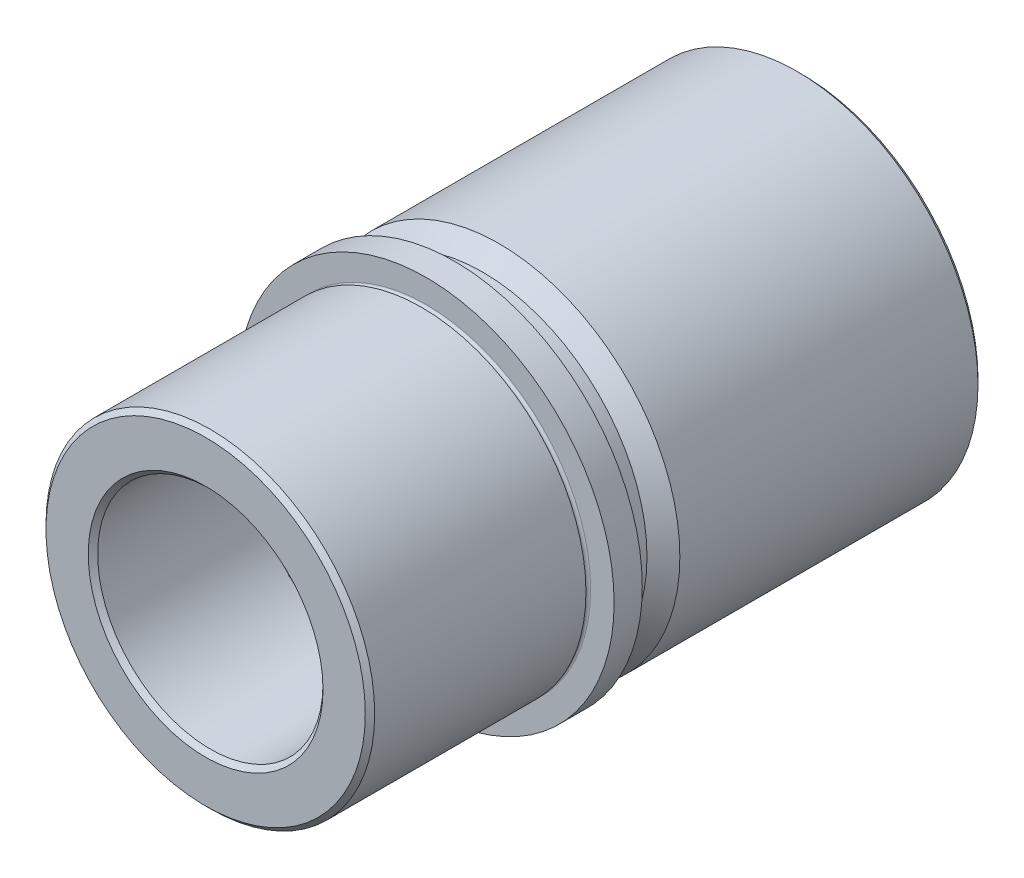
ISO-10303-21;
HEADER;
FILE_DESCRIPTION(('STEP AP214'),'2;1');
FILE_NAME('part.step','',(''),(''),'','','');
FILE_SCHEMA(('AUTOMOTIVE_DESIGN { 1 0 10303 214 1 1 1 1 }'));
ENDSEC;
DATA;
#1=APPLICATION_CONTEXT('core data for automotive mechanical design processes');
#2=APPLICATION_PROTOCOL_DEFINITION('international standard','automotive_design',2000,#1);
#3=PRODUCT_CONTEXT('',#1,'mechanical');
#4=PRODUCT('Part','Part','',(#3));
#5=PRODUCT_RELATED_PRODUCT_CATEGORY('part','',(#4));
#6=PRODUCT_DEFINITION_FORMATION('','',#4);
#7=PRODUCT_DEFINITION_CONTEXT('part definition',#1,'design');
#8=PRODUCT_DEFINITION('design','',#6,#7);
#9=PRODUCT_DEFINITION_SHAPE('','',#8);
#10=(LENGTH_UNIT() NAMED_UNIT(*) SI_UNIT(.MILLI.,.METRE.));
#11=(NAMED_UNIT(*) PLANE_ANGLE_UNIT() SI_UNIT($,.RADIAN.));
#12=(NAMED_UNIT(*) SI_UNIT($,.STERADIAN.) SOLID_ANGLE_UNIT());
#13=UNCERTAINTY_MEASURE_WITH_UNIT(LENGTH_MEASURE(1.E-05),#10,'distance_accuracy_value','');
#14=(GEOMETRIC_REPRESENTATION_CONTEXT(3) GLOBAL_UNCERTAINTY_ASSIGNED_CONTEXT((#13)) GLOBAL_UNIT_ASSIGNED_CONTEXT((#10,
#11,#12)) REPRESENTATION_CONTEXT('',''));
#15=CARTESIAN_POINT('',(0.,0.,0.));
#16=DIRECTION('',(0.,0.,1.));
#17=DIRECTION('',(1.,0.,0.));
#18=AXIS2_PLACEMENT_3D('',#15,#16,#17);
#19=CARTESIAN_POINT('',(0.,0.,-83.5));
#20=DIRECTION('',(0.,0.,1.));
#21=DIRECTION('',(1.,0.,0.));
#22=AXIS2_PLACEMENT_3D('',#19,#20,#21);
#23=TOROIDAL_SURFACE('',#22,24.5,0.5);
#24=CARTESIAN_POINT('',(0.,0.,-83.5));
#25=DIRECTION('',(0.,0.,1.));
#26=DIRECTION('',(1.,0.,0.));
#27=AXIS2_PLACEMENT_3D('',#24,#25,#26);
#28=CIRCLE('',#27,24.);
#29=CARTESIAN_POINT('',(24.,0.,-83.5));
#30=VERTEX_POINT('',#29);
#31=EDGE_CURVE('E81',#30,#30,#28,.T.);
#32=ORIENTED_EDGE('',*,*,#31,.T.);
#33=EDGE_LOOP('',(#32));
#34=FACE_BOUND('',#33,.T.);
#35=CARTESIAN_POINT('',(0.,0.,-84.));
#36=DIRECTION('',(0.,0.,1.));
#37=DIRECTION('',(1.,0.,0.));
#38=AXIS2_PLACEMENT_3D('',#35,#36,#37);
#39=CIRCLE('',#38,24.5);
#40=CARTESIAN_POINT('',(24.5,0.,-84.));
#41=VERTEX_POINT('',#40);
#42=EDGE_CURVE('E45',#41,#41,#39,.T.);
#43=ORIENTED_EDGE('',*,*,#42,.F.);
#44=EDGE_LOOP('',(#43));
#45=FACE_BOUND('',#44,.T.);
#46=ADVANCED_FACE('F13',(#34,#45),#23,.T.);
#47=CARTESIAN_POINT('',(0.,0.,-84.5));
#48=DIRECTION('',(0.,0.,1.));
#49=DIRECTION('',(1.,0.,0.));
#50=AXIS2_PLACEMENT_3D('',#47,#48,#49);
#51=TOROIDAL_SURFACE('',#50,24.5,0.5);
#52=CARTESIAN_POINT('',(0.,0.,-84.5));
#53=DIRECTION('',(0.,0.,1.));
#54=DIRECTION('',(1.,0.,0.));
#55=AXIS2_PLACEMENT_3D('',#52,#53,#54);
#56=CIRCLE('',#55,24.);
#57=CARTESIAN_POINT('',(24.,0.,-84.5));
#58=VERTEX_POINT('',#57);
#59=EDGE_CURVE('E48',#58,#58,#56,.T.);
#60=ORIENTED_EDGE('',*,*,#59,.F.);
#61=EDGE_LOOP('',(#60));
#62=FACE_BOUND('',#61,.T.);
#63=ORIENTED_EDGE('',*,*,#42,.T.);
#64=EDGE_LOOP('',(#63));
#65=FACE_BOUND('',#64,.T.);
#66=ADVANCED_FACE('F113',(#62,#65),#51,.T.);
#67=CARTESIAN_POINT('',(0.,0.,0.));
#68=DIRECTION('',(0.,0.,1.));
#69=DIRECTION('',(1.,0.,0.));
#70=AXIS2_PLACEMENT_3D('',#67,#68,#69);
#71=CYLINDRICAL_SURFACE('',#70,24.);
#72=CARTESIAN_POINT('',(0.,0.,-126.));
#73=DIRECTION('',(0.,0.,1.));
#74=DIRECTION('',(1.,0.,0.));
#75=AXIS2_PLACEMENT_3D('',#72,#73,#74);
#76=CIRCLE('',#75,24.);
#77=CARTESIAN_POINT('',(24.,0.,-126.));
#78=VERTEX_POINT('',#77);
#79=EDGE_CURVE('E36',#78,#78,#76,.F.);
#80=ORIENTED_EDGE('',*,*,#79,.T.);
#81=EDGE_LOOP('',(#80));
#82=FACE_BOUND('',#81,.T.);
#83=ORIENTED_EDGE('',*,*,#59,.T.);
#84=EDGE_LOOP('',(#83));
#85=FACE_BOUND('',#84,.T.);
#86=ADVANCED_FACE('F118',(#82,#85),#71,.F.);
#87=CARTESIAN_POINT('',(0.,0.,-127.));
#88=DIRECTION('',(0.,0.,1.));
#89=DIRECTION('',(1.,0.,0.));
#90=AXIS2_PLACEMENT_3D('',#87,#88,#89);
#91=PLANE('',#90);
#92=CARTESIAN_POINT('',(0.,0.,-127.));
#93=DIRECTION('',(0.,0.,1.));
#94=DIRECTION('',(1.,0.,0.));
#95=AXIS2_PLACEMENT_3D('',#92,#93,#94);
#96=CIRCLE('',#95,25.);
#97=CARTESIAN_POINT('',(25.,0.,-127.));
#98=VERTEX_POINT('',#97);
#99=EDGE_CURVE('E39',#98,#98,#96,.T.);
#100=ORIENTED_EDGE('',*,*,#99,.T.);
#101=EDGE_LOOP('',(#100));
#102=FACE_BOUND('',#101,.T.);
#103=CARTESIAN_POINT('',(0.,0.,-127.));
#104=DIRECTION('',(0.,0.,1.));
#105=DIRECTION('',(1.,0.,0.));
#106=AXIS2_PLACEMENT_3D('',#103,#104,#105);
#107=CIRCLE('',#106,37.5);
#108=CARTESIAN_POINT('',(37.5,0.,-127.));
#109=VERTEX_POINT('',#108);
#110=EDGE_CURVE('E42',#109,#109,#107,.F.);
#111=ORIENTED_EDGE('',*,*,#110,.T.);
#112=EDGE_LOOP('',(#111));
#113=FACE_BOUND('',#112,.T.);
#114=ADVANCED_FACE('F185',(#102,#113),#91,.F.);
#115=CARTESIAN_POINT('',(0.,0.,0.));
#116=DIRECTION('',(0.,0.,1.));
#117=DIRECTION('',(1.,0.,0.));
#118=AXIS2_PLACEMENT_3D('',#115,#116,#117);
#119=CYLINDRICAL_SURFACE('',#118,38.5);
#120=CARTESIAN_POINT('',(0.,0.,-126.));
#121=DIRECTION('',(0.,0.,1.));
#122=DIRECTION('',(1.,0.,0.));
#123=AXIS2_PLACEMENT_3D('',#120,#121,#122);
#124=CIRCLE('',#123,38.5);
#125=CARTESIAN_POINT('',(38.5,0.,-126.));
#126=VERTEX_POINT('',#125);
#127=EDGE_CURVE('E33',#126,#126,#124,.T.);
#128=ORIENTED_EDGE('',*,*,#127,.T.);
#129=EDGE_LOOP('',(#128));
#130=FACE_BOUND('',#129,.T.);
#131=CARTESIAN_POINT('',(0.,0.,-62.5));
#132=DIRECTION('',(0.,0.,1.));
#133=DIRECTION('',(1.,0.,0.));
#134=AXIS2_PLACEMENT_3D('',#131,#132,#133);
#135=CIRCLE('',#134,38.5);
#136=CARTESIAN_POINT('',(38.5,0.,-62.5));
#137=VERTEX_POINT('',#136);
#138=EDGE_CURVE('E51',#137,#137,#135,.T.);
#139=ORIENTED_EDGE('',*,*,#138,.F.);
#140=EDGE_LOOP('',(#139));
#141=FACE_BOUND('',#140,.T.);
#142=ADVANCED_FACE('F181',(#130,#141),#119,.T.);
#143=CARTESIAN_POINT('',(0.,0.,-59.));
#144=DIRECTION('',(0.,0.,-1.));
#145=DIRECTION('',(-1.,0.,0.));
#146=AXIS2_PLACEMENT_3D('',#143,#144,#145);
#147=CONICAL_SURFACE('',#146,35.,0.785398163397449);
#148=ORIENTED_EDGE('',*,*,#138,.T.);
#149=EDGE_LOOP('',(#148));
#150=FACE_BOUND('',#149,.T.);
#151=CARTESIAN_POINT('',(0.,0.,-59.));
#152=DIRECTION('',(0.,0.,1.));
#153=DIRECTION('',(1.,0.,0.));
#154=AXIS2_PLACEMENT_3D('',#151,#152,#153);
#155=CIRCLE('',#154,35.);
#156=CARTESIAN_POINT('',(35.,0.,-59.));
#157=VERTEX_POINT('',#156);
#158=EDGE_CURVE('E54',#157,#157,#155,.T.);
#159=ORIENTED_EDGE('',*,*,#158,.F.);
#160=EDGE_LOOP('',(#159));
#161=FACE_BOUND('',#160,.T.);
#162=ADVANCED_FACE('F177',(#150,#161),#147,.T.);
#163=CARTESIAN_POINT('',(0.,0.,0.));
#164=DIRECTION('',(0.,0.,1.));
#165=DIRECTION('',(1.,0.,0.));
#166=AXIS2_PLACEMENT_3D('',#163,#164,#165);
#167=CYLINDRICAL_SURFACE('',#166,35.);
#168=ORIENTED_EDGE('',*,*,#158,.T.);
#169=EDGE_LOOP('',(#168));
#170=FACE_BOUND('',#169,.T.);
#171=CARTESIAN_POINT('',(0.,0.,-53.));
#172=DIRECTION('',(0.,0.,1.));
#173=DIRECTION('',(1.,0.,0.));
#174=AXIS2_PLACEMENT_3D('',#171,#172,#173);
#175=CIRCLE('',#174,35.);
#176=CARTESIAN_POINT('',(35.,0.,-53.));
#177=VERTEX_POINT('',#176);
#178=EDGE_CURVE('E57',#177,#177,#175,.T.);
#179=ORIENTED_EDGE('',*,*,#178,.F.);
#180=EDGE_LOOP('',(#179));
#181=FACE_BOUND('',#180,.T.);
#182=ADVANCED_FACE('F173',(#170,#181),#167,.T.);
#183=CARTESIAN_POINT('',(0.,0.,-53.));
#184=DIRECTION('',(0.,0.,-1.));
#185=DIRECTION('',(-1.,0.,0.));
#186=AXIS2_PLACEMENT_3D('',#183,#184,#185);
#187=PLANE('',#186);
#188=ORIENTED_EDGE('',*,*,#178,.T.);
#189=EDGE_LOOP('',(#188));
#190=FACE_BOUND('',#189,.T.);
#191=CARTESIAN_POINT('',(0.,0.,-53.));
#192=DIRECTION('',(0.,0.,1.));
#193=DIRECTION('',(1.,0.,0.));
#194=AXIS2_PLACEMENT_3D('',#191,#192,#193);
#195=CIRCLE('',#194,40.);
#196=CARTESIAN_POINT('',(40.,0.,-53.));
#197=VERTEX_POINT('',#196);
#198=EDGE_CURVE('E60',#197,#197,#195,.T.);
#199=ORIENTED_EDGE('',*,*,#198,.F.);
#200=EDGE_LOOP('',(#199));
#201=FACE_BOUND('',#200,.T.);
#202=ADVANCED_FACE('F169',(#190,#201),#187,.T.);
#203=CARTESIAN_POINT('',(0.,0.,0.));
#204=DIRECTION('',(0.,0.,1.));
#205=DIRECTION('',(1.,0.,0.));
#206=AXIS2_PLACEMENT_3D('',#203,#204,#205);
#207=CYLINDRICAL_SURFACE('',#206,40.);
#208=ORIENTED_EDGE('',*,*,#198,.T.);
#209=EDGE_LOOP('',(#208));
#210=FACE_BOUND('',#209,.T.);
#211=CARTESIAN_POINT('',(0.,0.,-47.));
#212=DIRECTION('',(0.,0.,1.));
#213=DIRECTION('',(1.,0.,0.));
#214=AXIS2_PLACEMENT_3D('',#211,#212,#213);
#215=CIRCLE('',#214,40.);
#216=CARTESIAN_POINT('',(40.,0.,-47.));
#217=VERTEX_POINT('',#216);
#218=EDGE_CURVE('E63',#217,#217,#215,.T.);
#219=ORIENTED_EDGE('',*,*,#218,.F.);
#220=EDGE_LOOP('',(#219));
#221=FACE_BOUND('',#220,.T.);
#222=ADVANCED_FACE('F165',(#210,#221),#207,.T.);
#223=CARTESIAN_POINT('',(0.,0.,-47.));
#224=DIRECTION('',(0.,0.,1.));
#225=DIRECTION('',(1.,0.,0.));
#226=AXIS2_PLACEMENT_3D('',#223,#224,#225);
#227=PLANE('',#226);
#228=ORIENTED_EDGE('',*,*,#218,.T.);
#229=EDGE_LOOP('',(#228));
#230=FACE_BOUND('',#229,.T.);
#231=CARTESIAN_POINT('',(0.,0.,-47.));
#232=DIRECTION('',(0.,0.,1.));
#233=DIRECTION('',(1.,0.,0.));
#234=AXIS2_PLACEMENT_3D('',#231,#232,#233);
#235=CIRCLE('',#234,35.);
#236=CARTESIAN_POINT('',(35.,0.,-47.));
#237=VERTEX_POINT('',#236);
#238=EDGE_CURVE('E66',#237,#237,#235,.T.);
#239=ORIENTED_EDGE('',*,*,#238,.F.);
#240=EDGE_LOOP('',(#239));
#241=FACE_BOUND('',#240,.T.);
#242=ADVANCED_FACE('F161',(#230,#241),#227,.T.);
#243=CARTESIAN_POINT('',(0.,0.,-46.5));
#244=DIRECTION('',(0.,0.,1.));
#245=DIRECTION('',(1.,0.,0.));
#246=AXIS2_PLACEMENT_3D('',#243,#244,#245);
#247=TOROIDAL_SURFACE('',#246,35.,0.5);
#248=ORIENTED_EDGE('',*,*,#238,.T.);
#249=EDGE_LOOP('',(#248));
#250=FACE_BOUND('',#249,.T.);
#251=CARTESIAN_POINT('',(0.,0.,-46.));
#252=DIRECTION('',(0.,0.,1.));
#253=DIRECTION('',(1.,0.,0.));
#254=AXIS2_PLACEMENT_3D('',#251,#252,#253);
#255=CIRCLE('',#254,35.);
#256=CARTESIAN_POINT('',(35.,0.,-46.));
#257=VERTEX_POINT('',#256);
#258=EDGE_CURVE('E69',#257,#257,#255,.T.);
#259=ORIENTED_EDGE('',*,*,#258,.F.);
#260=EDGE_LOOP('',(#259));
#261=FACE_BOUND('',#260,.T.);
#262=ADVANCED_FACE('F156',(#250,#261),#247,.F.);
#263=CARTESIAN_POINT('',(0.,0.,0.));
#264=DIRECTION('',(0.,0.,1.));
#265=DIRECTION('',(1.,0.,0.));
#266=AXIS2_PLACEMENT_3D('',#263,#264,#265);
#267=CYLINDRICAL_SURFACE('',#266,35.);
#268=CARTESIAN_POINT('',(0.,0.,-1.));
#269=DIRECTION('',(0.,0.,1.));
#270=DIRECTION('',(1.,0.,0.));
#271=AXIS2_PLACEMENT_3D('',#268,#269,#270);
#272=CIRCLE('',#271,35.);
#273=CARTESIAN_POINT('',(35.,0.,-1.));
#274=VERTEX_POINT('',#273);
#275=EDGE_CURVE('E8',#274,#274,#272,.F.);
#276=ORIENTED_EDGE('',*,*,#275,.T.);
#277=EDGE_LOOP('',(#276));
#278=FACE_BOUND('',#277,.T.);
#279=ORIENTED_EDGE('',*,*,#258,.T.);
#280=EDGE_LOOP('',(#279));
#281=FACE_BOUND('',#280,.T.);
#282=ADVANCED_FACE('F149',(#278,#281),#267,.T.);
#283=CARTESIAN_POINT('',(0.,0.,0.));
#284=DIRECTION('',(0.,0.,1.));
#285=DIRECTION('',(1.,0.,0.));
#286=AXIS2_PLACEMENT_3D('',#283,#284,#285);
#287=PLANE('',#286);
#288=CARTESIAN_POINT('',(0.,0.,0.));
#289=DIRECTION('',(0.,0.,1.));
#290=DIRECTION('',(1.,0.,0.));
#291=AXIS2_PLACEMENT_3D('',#288,#289,#290);
#292=CIRCLE('',#291,25.);
#293=CARTESIAN_POINT('',(25.,0.,0.));
#294=VERTEX_POINT('',#293);
#295=EDGE_CURVE('E20',#294,#294,#292,.F.);
#296=ORIENTED_EDGE('',*,*,#295,.T.);
#297=EDGE_LOOP('',(#296));
#298=FACE_BOUND('',#297,.T.);
#299=CARTESIAN_POINT('',(0.,0.,0.));
#300=DIRECTION('',(0.,0.,1.));
#301=DIRECTION('',(1.,0.,0.));
#302=AXIS2_PLACEMENT_3D('',#299,#300,#301);
#303=CIRCLE('',#302,34.);
#304=CARTESIAN_POINT('',(34.,0.,0.));
#305=VERTEX_POINT('',#304);
#306=EDGE_CURVE('E24',#305,#305,#303,.T.);
#307=ORIENTED_EDGE('',*,*,#306,.T.);
#308=EDGE_LOOP('',(#307));
#309=FACE_BOUND('',#308,.T.);
#310=ADVANCED_FACE('F109',(#298,#309),#287,.T.);
#311=CARTESIAN_POINT('',(0.,0.,0.));
#312=DIRECTION('',(0.,0.,1.));
#313=DIRECTION('',(1.,0.,0.));
#314=AXIS2_PLACEMENT_3D('',#311,#312,#313);
#315=CYLINDRICAL_SURFACE('',#314,24.);
#316=CARTESIAN_POINT('',(0.,0.,-1.00000000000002));
#317=DIRECTION('',(0.,0.,1.));
#318=DIRECTION('',(1.,0.,0.));
#319=AXIS2_PLACEMENT_3D('',#316,#317,#318);
#320=CIRCLE('',#319,24.);
#321=CARTESIAN_POINT('',(24.,0.,-1.00000000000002));
#322=VERTEX_POINT('',#321);
#323=EDGE_CURVE('E28',#322,#322,#320,.T.);
#324=ORIENTED_EDGE('',*,*,#323,.T.);
#325=EDGE_LOOP('',(#324));
#326=FACE_BOUND('',#325,.T.);
#327=CARTESIAN_POINT('',(0.,0.,-34.5));
#328=DIRECTION('',(0.,0.,1.));
#329=DIRECTION('',(1.,0.,0.));
#330=AXIS2_PLACEMENT_3D('',#327,#328,#329);
#331=CIRCLE('',#330,24.);
#332=CARTESIAN_POINT('',(24.,0.,-34.5));
#333=VERTEX_POINT('',#332);
#334=EDGE_CURVE('E72',#333,#333,#331,.T.);
#335=ORIENTED_EDGE('',*,*,#334,.F.);
#336=EDGE_LOOP('',(#335));
#337=FACE_BOUND('',#336,.T.);
#338=ADVANCED_FACE('F102',(#326,#337),#315,.F.);
#339=CARTESIAN_POINT('',(0.,0.,-34.5));
#340=DIRECTION('',(0.,0.,1.));
#341=DIRECTION('',(1.,0.,0.));
#342=AXIS2_PLACEMENT_3D('',#339,#340,#341);
#343=TOROIDAL_SURFACE('',#342,24.5,0.5);
#344=ORIENTED_EDGE('',*,*,#334,.T.);
#345=EDGE_LOOP('',(#344));
#346=FACE_BOUND('',#345,.T.);
#347=CARTESIAN_POINT('',(0.,0.,-35.));
#348=DIRECTION('',(0.,0.,1.));
#349=DIRECTION('',(1.,0.,0.));
#350=AXIS2_PLACEMENT_3D('',#347,#348,#349);
#351=CIRCLE('',#350,24.5);
#352=CARTESIAN_POINT('',(24.5,0.,-35.));
#353=VERTEX_POINT('',#352);
#354=EDGE_CURVE('E75',#353,#353,#351,.T.);
#355=ORIENTED_EDGE('',*,*,#354,.F.);
#356=EDGE_LOOP('',(#355));
#357=FACE_BOUND('',#356,.T.);
#358=ADVANCED_FACE('F97',(#346,#357),#343,.T.);
#359=CARTESIAN_POINT('',(0.,0.,-35.5));
#360=DIRECTION('',(0.,0.,1.));
#361=DIRECTION('',(1.,0.,0.));
#362=AXIS2_PLACEMENT_3D('',#359,#360,#361);
#363=TOROIDAL_SURFACE('',#362,24.5,0.5);
#364=CARTESIAN_POINT('',(0.,0.,-35.5));
#365=DIRECTION('',(0.,0.,1.));
#366=DIRECTION('',(1.,0.,0.));
#367=AXIS2_PLACEMENT_3D('',#364,#365,#366);
#368=CIRCLE('',#367,24.);
#369=CARTESIAN_POINT('',(24.,0.,-35.5));
#370=VERTEX_POINT('',#369);
#371=EDGE_CURVE('E78',#370,#370,#368,.T.);
#372=ORIENTED_EDGE('',*,*,#371,.F.);
#373=EDGE_LOOP('',(#372));
#374=FACE_BOUND('',#373,.T.);
#375=ORIENTED_EDGE('',*,*,#354,.T.);
#376=EDGE_LOOP('',(#375));
#377=FACE_BOUND('',#376,.T.);
#378=ADVANCED_FACE('F91',(#374,#377),#363,.T.);
#379=CARTESIAN_POINT('',(0.,0.,0.));
#380=DIRECTION('',(0.,0.,1.));
#381=DIRECTION('',(1.,0.,0.));
#382=AXIS2_PLACEMENT_3D('',#379,#380,#381);
#383=CYLINDRICAL_SURFACE('',#382,24.);
#384=ORIENTED_EDGE('',*,*,#31,.F.);
#385=EDGE_LOOP('',(#384));
#386=FACE_BOUND('',#385,.T.);
#387=ORIENTED_EDGE('',*,*,#371,.T.);
#388=EDGE_LOOP('',(#387));
#389=FACE_BOUND('',#388,.T.);
#390=ADVANCED_FACE('F87',(#386,#389),#383,.F.);
#391=CARTESIAN_POINT('',(0.,0.,-127.));
#392=DIRECTION('',(0.,0.,-1.));
#393=DIRECTION('',(-1.,0.,0.));
#394=AXIS2_PLACEMENT_3D('',#391,#392,#393);
#395=CONICAL_SURFACE('',#394,25.,0.78539816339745);
#396=ORIENTED_EDGE('',*,*,#79,.F.);
#397=EDGE_LOOP('',(#396));
#398=FACE_BOUND('',#397,.T.);
#399=ORIENTED_EDGE('',*,*,#99,.F.);
#400=EDGE_LOOP('',(#399));
#401=FACE_BOUND('',#400,.T.);
#402=ADVANCED_FACE('F90',(#398,#401),#395,.F.);
#403=CARTESIAN_POINT('',(0.,0.,-126.));
#404=DIRECTION('',(0.,0.,1.));
#405=DIRECTION('',(1.,0.,0.));
#406=AXIS2_PLACEMENT_3D('',#403,#404,#405);
#407=CONICAL_SURFACE('',#406,38.5,0.785398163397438);
#408=ORIENTED_EDGE('',*,*,#110,.F.);
#409=EDGE_LOOP('',(#408));
#410=FACE_BOUND('',#409,.T.);
#411=ORIENTED_EDGE('',*,*,#127,.F.);
#412=EDGE_LOOP('',(#411));
#413=FACE_BOUND('',#412,.T.);
#414=ADVANCED_FACE('F125',(#410,#413),#407,.T.);
#415=CARTESIAN_POINT('',(0.,0.,-1.00000000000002));
#416=DIRECTION('',(0.,0.,1.));
#417=DIRECTION('',(1.,0.,0.));
#418=AXIS2_PLACEMENT_3D('',#415,#416,#417);
#419=CONICAL_SURFACE('',#418,24.,0.78539816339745);
#420=ORIENTED_EDGE('',*,*,#295,.F.);
#421=EDGE_LOOP('',(#420));
#422=FACE_BOUND('',#421,.T.);
#423=ORIENTED_EDGE('',*,*,#323,.F.);
#424=EDGE_LOOP('',(#423));
#425=FACE_BOUND('',#424,.T.);
#426=ADVANCED_FACE('F128',(#422,#425),#419,.F.);
#427=CARTESIAN_POINT('',(0.,0.,0.));
#428=DIRECTION('',(0.,0.,-1.));
#429=DIRECTION('',(-1.,0.,0.));
#430=AXIS2_PLACEMENT_3D('',#427,#428,#429);
#431=CONICAL_SURFACE('',#430,34.,0.785398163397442);
#432=ORIENTED_EDGE('',*,*,#275,.F.);
#433=EDGE_LOOP('',(#432));
#434=FACE_BOUND('',#433,.T.);
#435=ORIENTED_EDGE('',*,*,#306,.F.);
#436=EDGE_LOOP('',(#435));
#437=FACE_BOUND('',#436,.T.);
#438=ADVANCED_FACE('F15',(#434,#437),#431,.T.);
#439=CLOSED_SHELL('',(#46,#66,#86,#114,#142,#162,#182,#202,#222,#242,#262,#282,#310,#338,#358,
#378,#390,#402,#414,#426,#438));
#440=MANIFOLD_SOLID_BREP('B1',#439);
#441=ADVANCED_BREP_SHAPE_REPRESENTATION('',(#18,#440),#14);
#442=SHAPE_DEFINITION_REPRESENTATION(#9,#441);
ENDSEC;
END-ISO-10303-21;
